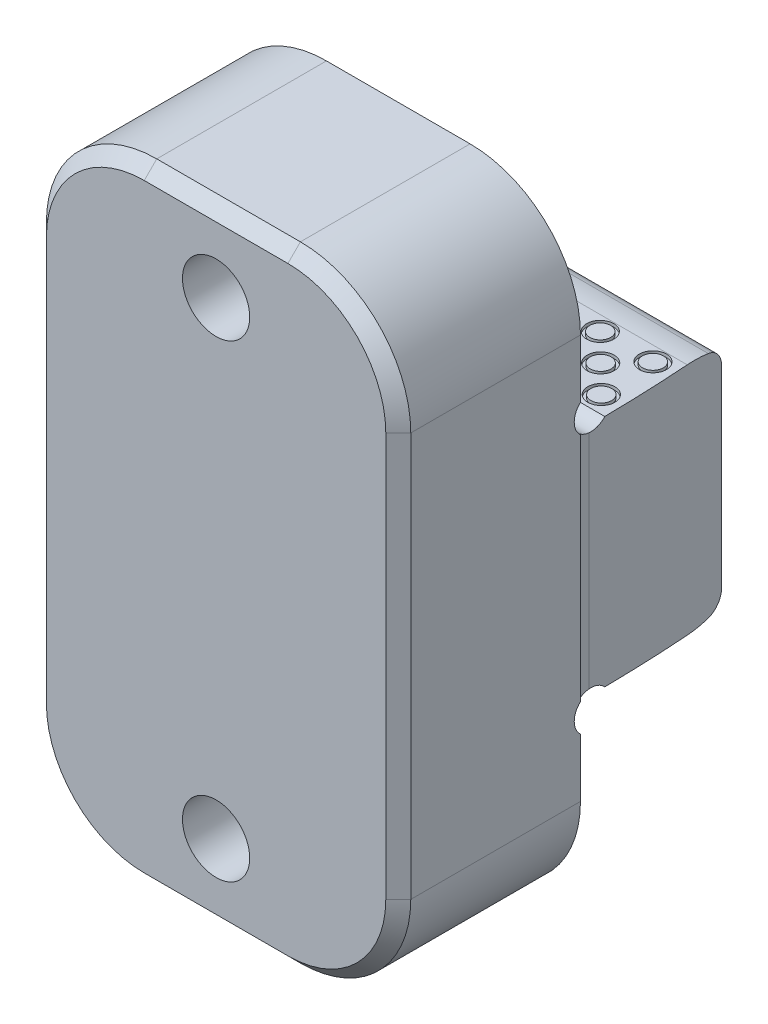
from build123d import *

# Parameters (mm, degrees)
EXTRUDE1_DEPTH              = 22.225
SKETCH7_W                   = 21.968267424
SKETCH7_H                   = 31.720833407
CUT_EXTRUDE3_DEPTH          = 0.254
SKETCH8_R                   = 2.286
CUT_EXTRUDE4_DEPTH          = 63.620788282
CUT_EXTRUDE5_DEPTH          = 63.620788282
CUT_EXTRUDE6_DEPTH          = 83.427794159
SKETCH15_R                  = 1.651
SKETCH15_R_2                = 1.27
CUT_EXTRUDE7_DEPTH          = 0.381
F_5_16_18_CBORE_D           = 7.62
F_5_16_18_CBORE_CBORE_D     = 13.49502
F_5_16_18_CBORE_CBORE_DEPTH = 8.73252
F_3_8_16_TAPPED_HOLE1_D     = 8.2042
FILLET1_R                   = 13.462
CHAMFER1_SIZE               = 1.524


with BuildPart() as part:
    # Sketch3 → Extrude1 (new, symmetric)
    with BuildSketch(Plane(origin=(0, 0, 0), x_dir=(0, 0, -1), z_dir=(1, 0, 0))):
        Polygon((-22.225, -38.1), (0, -38.1), (0, -14.28496), (18.288, -14.28496), (18.288, 14.28496), (0, 14.28496), (0, 38.1), (-22.225, 38.1), align=None)
    extrude(amount=EXTRUDE1_DEPTH, both=True)

    # Sketch7 → Cut-Extrude3 (cut)
    with BuildSketch(Plane(origin=(22.225, 0, 0), x_dir=(0, 0, -1), z_dir=(1, 0, 0))):
        with Locations((10.984133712, 1.307835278)):
            Rectangle(SKETCH7_W, SKETCH7_H)
    cut_extrude3 = extrude(amount=-CUT_EXTRUDE3_DEPTH, mode=Mode.SUBTRACT)

    # Mirror2: Cut-Extrude3 across plane
    add(cut_extrude3.mirror(Plane(origin=(0, 0, 0), x_dir=(0, 0, 1), z_dir=(1, 0, 0))), mode=Mode.SUBTRACT)

    # Sketch8 → Cut-Extrude4 (cut, through all)
    with BuildSketch(Plane(origin=(22.225, 0, 0), x_dir=(0, 0, -1), z_dir=(1, 0, 0))):
        with Locations((1.524, 15.80896)):
            Circle(SKETCH8_R)
        with Locations((1.524, -15.80896)):
            Circle(SKETCH8_R)
    extrude(amount=-CUT_EXTRUDE4_DEPTH, mode=Mode.SUBTRACT)

    # Sketch9 → Cut-Extrude5 (cut, through all)
    with BuildSketch(Plane(origin=(22.225, 0, 0), x_dir=(0, 0, -1), z_dir=(1, 0, 0))):
        with BuildLine():
            Line((18.288, 11.74496), (20.066, 11.74496))
            Line((20.066, 11.74496), (20.066, 18.09496))
            Line((20.066, 18.09496), (13.716, 18.09496))
            Line((13.716, 18.09496), (13.716, 14.28496))
            ThreePointArc((13.716, 14.28496), (15.118480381, 14.20728343), (16.503804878, 13.975203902))
            ThreePointArc((16.503804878, 13.975203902), (17.787066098, 13.173012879), (18.288, 11.74496))
        make_face()
        with BuildLine():
            Line((20.066, -11.74496), (20.066, -18.09496))
            Line((20.066, -18.09496), (13.716, -18.09496))
            Line((13.716, -18.09496), (13.716, -14.28496))
            ThreePointArc((13.716, -14.28496), (15.118480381, -14.20728343), (16.503804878, -13.975203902))
            ThreePointArc((16.503804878, -13.975203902), (17.787066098, -13.173012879), (18.288, -11.74496))
            Line((18.288, -11.74496), (20.066, -11.74496))
        make_face()
    extrude(amount=-CUT_EXTRUDE5_DEPTH, mode=Mode.SUBTRACT)

    # Sketch13 → Cut-Extrude6 (cut, through all)
    with BuildSketch(Plane(origin=(0, 38.1, 0), x_dir=(1, 0, 0), z_dir=(0, 1, 0))):
        with BuildLine():
            Line((20.147362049, 26.67), (32.847362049, 26.67))
            Line((32.847362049, 26.67), (32.847362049, 1.27))
            Line((32.847362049, 1.27), (21.971, 1.27))
            ThreePointArc((21.971, 1.27), (21.514504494, 14.002690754), (20.147362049, 26.67))
        make_face()
    extrude(amount=-CUT_EXTRUDE6_DEPTH, mode=Mode.SUBTRACT)

    # Sketch15 → Cut-Extrude7 (cut)
    # profile 1 of 20: a face of its own
    with BuildSketch(Plane(origin=(0, 14.28496, 0), x_dir=(1, 0, 0), z_dir=(0, 1, 0))):
        with Locations(Location((-13.0048, 11.938, 0), (0, 0, 270))):
            Circle(SKETCH15_R)
        with Locations(Location((-13.0048, 11.938, 0), (0, 0, 270))):
            Circle(SKETCH15_R_2, mode=Mode.SUBTRACT)
    # profile 2 of 20: a face of its own
    with BuildSketch(Plane(origin=(0, 14.28496, 0), x_dir=(1, 0, 0), z_dir=(0, 1, 0))):
        with Locations(Location((-6.5786, 11.938, 0), (0, 0, 270))):
            Circle(SKETCH15_R)
        with Locations(Location((-6.5786, 11.938, 0), (0, 0, 270))):
            Circle(SKETCH15_R_2, mode=Mode.SUBTRACT)
    # profile 3 of 20: a face of its own
    with BuildSketch(Plane(origin=(0, 14.28496, 0), x_dir=(1, 0, 0), z_dir=(0, 1, 0))):
        with Locations(Location((-19.431, 11.938, 0), (0, 0, 270))):
            Circle(SKETCH15_R)
        with Locations(Location((-19.431, 11.938, 0), (0, 0, 270))):
            Circle(SKETCH15_R_2, mode=Mode.SUBTRACT)
    # profile 4 of 20: a face of its own
    with BuildSketch(Plane(origin=(0, 14.28496, 0), x_dir=(1, 0, 0), z_dir=(0, 1, 0))):
        with Locations(Location((-0.1524, 11.938, 0), (0, 0, 270))):
            Circle(SKETCH15_R)
        with Locations(Location((-0.1524, 11.938, 0), (0, 0, 270))):
            Circle(SKETCH15_R_2, mode=Mode.SUBTRACT)
    # profile 5 of 20: a face of its own
    with BuildSketch(Plane(origin=(0, 14.28496, 0), x_dir=(1, 0, 0), z_dir=(0, 1, 0))):
        with Locations(Location((6.2738, 11.938, 0), (0, 0, 270))):
            Circle(SKETCH15_R)
        with Locations(Location((6.2738, 11.938, 0), (0, 0, 270))):
            Circle(SKETCH15_R_2, mode=Mode.SUBTRACT)
    # profile 6 of 20: a face of its own
    with BuildSketch(Plane(origin=(0, 14.28496, 0), x_dir=(1, 0, 0), z_dir=(0, 1, 0))):
        with Locations(Location((12.7, 11.938, 0), (0, 0, 270))):
            Circle(SKETCH15_R)
        with Locations(Location((12.7, 11.938, 0), (0, 0, 270))):
            Circle(SKETCH15_R_2, mode=Mode.SUBTRACT)
    # profile 7 of 20: a face of its own
    with BuildSketch(Plane(origin=(0, 14.28496, 0), x_dir=(1, 0, 0), z_dir=(0, 1, 0))):
        with Locations(Location((19.1262, 11.938, 0), (0, 0, 270))):
            Circle(SKETCH15_R)
        with Locations(Location((19.1262, 11.938, 0), (0, 0, 270))):
            Circle(SKETCH15_R_2, mode=Mode.SUBTRACT)
    # profile 8 of 20: a face of its own
    with BuildSketch(Plane(origin=(0, 14.28496, 0), x_dir=(1, 0, 0), z_dir=(0, 1, 0))):
        with Locations(Location((-9.7536, 8.636, 0), (0, 0, 270))):
            Circle(SKETCH15_R)
        with Locations(Location((-9.7536, 8.636, 0), (0, 0, 270))):
            Circle(SKETCH15_R_2, mode=Mode.SUBTRACT)
    # profile 9 of 20: a face of its own
    with BuildSketch(Plane(origin=(0, 14.28496, 0), x_dir=(1, 0, 0), z_dir=(0, 1, 0))):
        with Locations(Location((-3.302, 8.636, 0), (0, 0, 270))):
            Circle(SKETCH15_R)
        with Locations(Location((-3.302, 8.636, 0), (0, 0, 270))):
            Circle(SKETCH15_R_2, mode=Mode.SUBTRACT)
    # profile 10 of 20: a face of its own
    with BuildSketch(Plane(origin=(0, 14.28496, 0), x_dir=(1, 0, 0), z_dir=(0, 1, 0))):
        with Locations(Location((-16.2052, 8.636, 0), (0, 0, 270))):
            Circle(SKETCH15_R)
        with Locations(Location((-16.2052, 8.636, 0), (0, 0, 270))):
            Circle(SKETCH15_R_2, mode=Mode.SUBTRACT)
    # profile 11 of 20: a face of its own
    with BuildSketch(Plane(origin=(0, 14.28496, 0), x_dir=(1, 0, 0), z_dir=(0, 1, 0))):
        with Locations(Location((3.1496, 8.636, 0), (0, 0, 270))):
            Circle(SKETCH15_R)
        with Locations(Location((3.1496, 8.636, 0), (0, 0, 270))):
            Circle(SKETCH15_R_2, mode=Mode.SUBTRACT)
    # profile 12 of 20: a face of its own
    with BuildSketch(Plane(origin=(0, 14.28496, 0), x_dir=(1, 0, 0), z_dir=(0, 1, 0))):
        with Locations(Location((9.6012, 8.636, 0), (0, 0, 270))):
            Circle(SKETCH15_R)
        with Locations(Location((9.6012, 8.636, 0), (0, 0, 270))):
            Circle(SKETCH15_R_2, mode=Mode.SUBTRACT)
    # profile 13 of 20: a face of its own
    with BuildSketch(Plane(origin=(0, 14.28496, 0), x_dir=(1, 0, 0), z_dir=(0, 1, 0))):
        with Locations(Location((16.0528, 8.636, 0), (0, 0, 270))):
            Circle(SKETCH15_R)
        with Locations(Location((16.0528, 8.636, 0), (0, 0, 270))):
            Circle(SKETCH15_R_2, mode=Mode.SUBTRACT)
    # profile 14 of 20: a face of its own
    with BuildSketch(Plane(origin=(0, 14.28496, 0), x_dir=(1, 0, 0), z_dir=(0, 1, 0))):
        with Locations(Location((-12.954, 5.334, 0), (0, 0, 270))):
            Circle(SKETCH15_R)
        with Locations(Location((-12.954, 5.334, 0), (0, 0, 270))):
            Circle(SKETCH15_R_2, mode=Mode.SUBTRACT)
    # profile 15 of 20: a face of its own
    with BuildSketch(Plane(origin=(0, 14.28496, 0), x_dir=(1, 0, 0), z_dir=(0, 1, 0))):
        with Locations(Location((-6.477, 5.334, 0), (0, 0, 270))):
            Circle(SKETCH15_R)
        with Locations(Location((-6.477, 5.334, 0), (0, 0, 270))):
            Circle(SKETCH15_R_2, mode=Mode.SUBTRACT)
    # profile 16 of 20: a face of its own
    with BuildSketch(Plane(origin=(0, 14.28496, 0), x_dir=(1, 0, 0), z_dir=(0, 1, 0))):
        with Locations(Location((-19.431, 5.334, 0), (0, 0, 270))):
            Circle(SKETCH15_R)
        with Locations(Location((-19.431, 5.334, 0), (0, 0, 270))):
            Circle(SKETCH15_R_2, mode=Mode.SUBTRACT)
    # profile 17 of 20: a face of its own
    with BuildSketch(Plane(origin=(0, 14.28496, 0), x_dir=(1, 0, 0), z_dir=(0, 1, 0))):
        with Locations(Location((0, 5.334, 0), (0, 0, 270))):
            Circle(SKETCH15_R)
        with Locations(Location((0, 5.334, 0), (0, 0, 270))):
            Circle(SKETCH15_R_2, mode=Mode.SUBTRACT)
    # profile 18 of 20: a face of its own
    with BuildSketch(Plane(origin=(0, 14.28496, 0), x_dir=(1, 0, 0), z_dir=(0, 1, 0))):
        with Locations(Location((6.477, 5.334, 0), (0, 0, 270))):
            Circle(SKETCH15_R)
        with Locations(Location((6.477, 5.334, 0), (0, 0, 270))):
            Circle(SKETCH15_R_2, mode=Mode.SUBTRACT)
    # profile 19 of 20: a face of its own
    with BuildSketch(Plane(origin=(0, 14.28496, 0), x_dir=(1, 0, 0), z_dir=(0, 1, 0))):
        with Locations(Location((12.954, 5.334, 0), (0, 0, 270))):
            Circle(SKETCH15_R)
        with Locations(Location((12.954, 5.334, 0), (0, 0, 270))):
            Circle(SKETCH15_R_2, mode=Mode.SUBTRACT)
    # profile 20 of 20: a face of its own
    with BuildSketch(Plane(origin=(0, 14.28496, 0), x_dir=(1, 0, 0), z_dir=(0, 1, 0))):
        with Locations(Location((19.431, 5.334, 0), (0, 0, 270))):
            Circle(SKETCH15_R)
        with Locations(Location((19.431, 5.334, 0), (0, 0, 270))):
            Circle(SKETCH15_R_2, mode=Mode.SUBTRACT)
    cut_extrude7 = extrude(amount=-CUT_EXTRUDE7_DEPTH, mode=Mode.SUBTRACT)

    # Mirror1: Cut-Extrude7 across plane
    add(cut_extrude7.mirror(Plane.ZX), mode=Mode.SUBTRACT)

    # 5_16_-18 CBORE (through all)
    with Locations(Plane(origin=(0, 0, 0), x_dir=(-1, 0, 0), z_dir=(0, 0, -1))):
        with Locations((0, 28.575), (0, -28.575)):
            CounterBoreHole(F_5_16_18_CBORE_D / 2, F_5_16_18_CBORE_CBORE_D / 2, F_5_16_18_CBORE_CBORE_DEPTH)

    # 3_8-16 Tapped Hole1 (through all)
    with Locations(Plane(origin=(0, 0, 8.73252), x_dir=(-1, 0, 0), z_dir=(0, 0, -1))):
        with Locations((0, 28.575), (0, -28.575)):
            Hole(F_3_8_16_TAPPED_HOLE1_D / 2)

    # Fillet1
    fillet1_edges = [part.edges().sort_by_distance(p)[0] for p in [
        (-22.225, -38.1, 11.1125),
        (22.225, 38.1, 11.1125),
        (22.225, -38.1, 11.1125),
        (-22.225, 38.1, 11.1125),
    ]]
    fillet(fillet1_edges, radius=FILLET1_R)

    # Chamfer1
    chamfer1_edges = [part.edges().sort_by_distance(p)[0] for p in [
        (22.225, 0, 22.225),
        (0, -38.1, 22.225),
        (-22.225, 0, 22.225),
        (0, 38.1, 22.225),
        (-18.282071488, -34.157071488, 22.225),
        (-18.282071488, 34.157071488, 22.225),
        (18.282071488, 34.157071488, 22.225),
        (18.282071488, -34.157071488, 22.225),
    ]]
    chamfer(chamfer1_edges, length=CHAMFER1_SIZE)


solid = part.part
